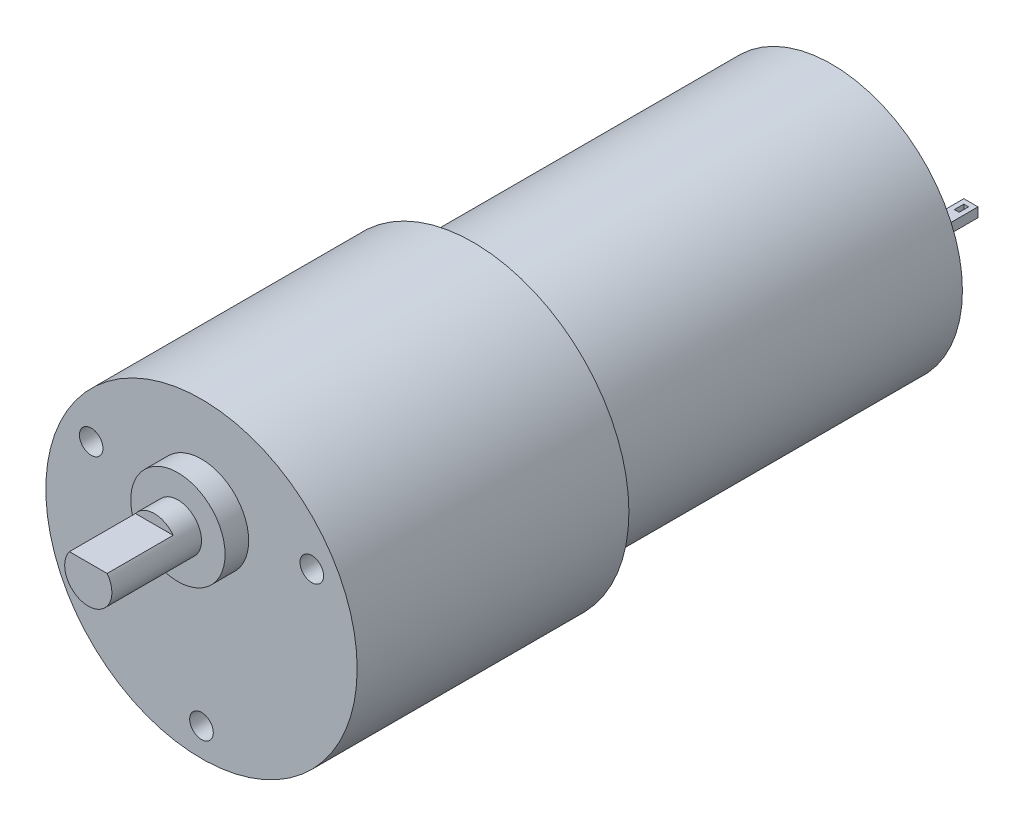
from build123d import *

# Parameters (mm, degrees)
ESQUISSE1_R             = 13.85
BOSS_EXTRU_1_DEPTH      = 38
ESQUISSE2_R             = 5
BOSS_EXTRU_2_DEPTH      = 2.8
ESQUISSE3_W             = 1.5
ESQUISSE3_H             = 8
ESQUISSE3_W_2           = 0.5
ESQUISSE3_H_2           = 1
BOSS_EXTRU_3_DEPTH      = 0.5
ESQUISSE4_R             = 16.5
BOSS_EXTRU_4_DEPTH      = 28.8
TROU_TARAUD_M31_D       = 2.5
TROU_TARAUD_M31_DEPTH   = 7.748924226
TROU_TARAUD_M31_TIP     = 0.751075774
ESQUISSE6_R             = 5
BOSS_EXTRU_5_DEPTH      = 2.5
ESQUISSE7_R             = 2.5
BOSS_EXTRU_6_DEPTH      = 9.5
ENL_V_START             = -7
ENL_V_MAT_EXTRU_1_DEPTH = 7


with BuildPart() as part:
    # Esquisse1 → Boss.-Extru.1 (new body)
    with BuildSketch(Plane.XY):
        Circle(ESQUISSE1_R)
    extrude(amount=BOSS_EXTRU_1_DEPTH)

    # Esquisse2 → Boss.-Extru.2 (add)
    with BuildSketch(Plane(origin=(0, 0, 0), x_dir=(-1, 0, 0), z_dir=(0, 0, -1))):
        Circle(ESQUISSE2_R)
    extrude(amount=BOSS_EXTRU_2_DEPTH)

    # Esquisse3 → Boss.-Extru.3 (add, symmetric)
    # profile 1 of 2: a face of its own
    with BuildSketch(Plane(origin=(0, 0, 0), x_dir=(1, 0, 0), z_dir=(0, 1, 0))):
        with Locations((-6.75, 4)):
            Rectangle(ESQUISSE3_W, ESQUISSE3_H)
        with Locations((-6.75, 7)):
            Rectangle(ESQUISSE3_W_2, ESQUISSE3_H_2, mode=Mode.SUBTRACT)
    # profile 2 of 2: a face of its own
    with BuildSketch(Plane(origin=(0, 0, 0), x_dir=(1, 0, 0), z_dir=(0, 1, 0))):
        with Locations((6.75, 4)):
            Rectangle(ESQUISSE3_W, ESQUISSE3_H)
        with Locations((6.75, 7)):
            Rectangle(ESQUISSE3_W_2, ESQUISSE3_H_2, mode=Mode.SUBTRACT)
    extrude(amount=BOSS_EXTRU_3_DEPTH, both=True)

    # Esquisse4 → Boss.-Extru.4 (add)
    with BuildSketch(Plane.XY.offset(38)):
        Circle(ESQUISSE4_R)
    extrude(amount=BOSS_EXTRU_4_DEPTH)

    # Trou taraud_ M31
    with Locations(Plane(origin=(0, -13.5, 66.8), x_dir=(1, 0, 0), z_dir=(0, 0, 1))):
        with Locations((0, 0), (-11.691342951, 20.25), (11.691342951, 20.25)):
            Hole(TROU_TARAUD_M31_D / 2, depth=TROU_TARAUD_M31_DEPTH)
            with Locations((0, 0, -(TROU_TARAUD_M31_DEPTH + TROU_TARAUD_M31_TIP / 2))):  # 118° drill point
                Cone(0, TROU_TARAUD_M31_D / 2, TROU_TARAUD_M31_TIP, mode=Mode.SUBTRACT)

    # Esquisse6 → Boss.-Extru.5 (add)
    with BuildSketch(Plane.XY.offset(66.8)):
        with Locations((0, 6)):
            Circle(ESQUISSE6_R)
    extrude(amount=BOSS_EXTRU_5_DEPTH)

    # Esquisse7 → Boss.-Extru.6 (add)
    with BuildSketch(Plane.XY.offset(69.3)):
        with Locations((0, 6)):
            Circle(ESQUISSE7_R)
    extrude(amount=BOSS_EXTRU_6_DEPTH)

    # Esquisse8 → Enl_v. mat.-Extru.1 (cut)
    with BuildSketch(Plane.XY.offset(78.8).offset(ENL_V_START)):
        with BuildLine():
            Line((-2, 7.5), (2, 7.5))
            ThreePointArc((2, 7.5), (0, 8.5), (-2, 7.5))
        make_face()
    extrude(amount=ENL_V_MAT_EXTRU_1_DEPTH, mode=Mode.SUBTRACT)


solid = part.part
